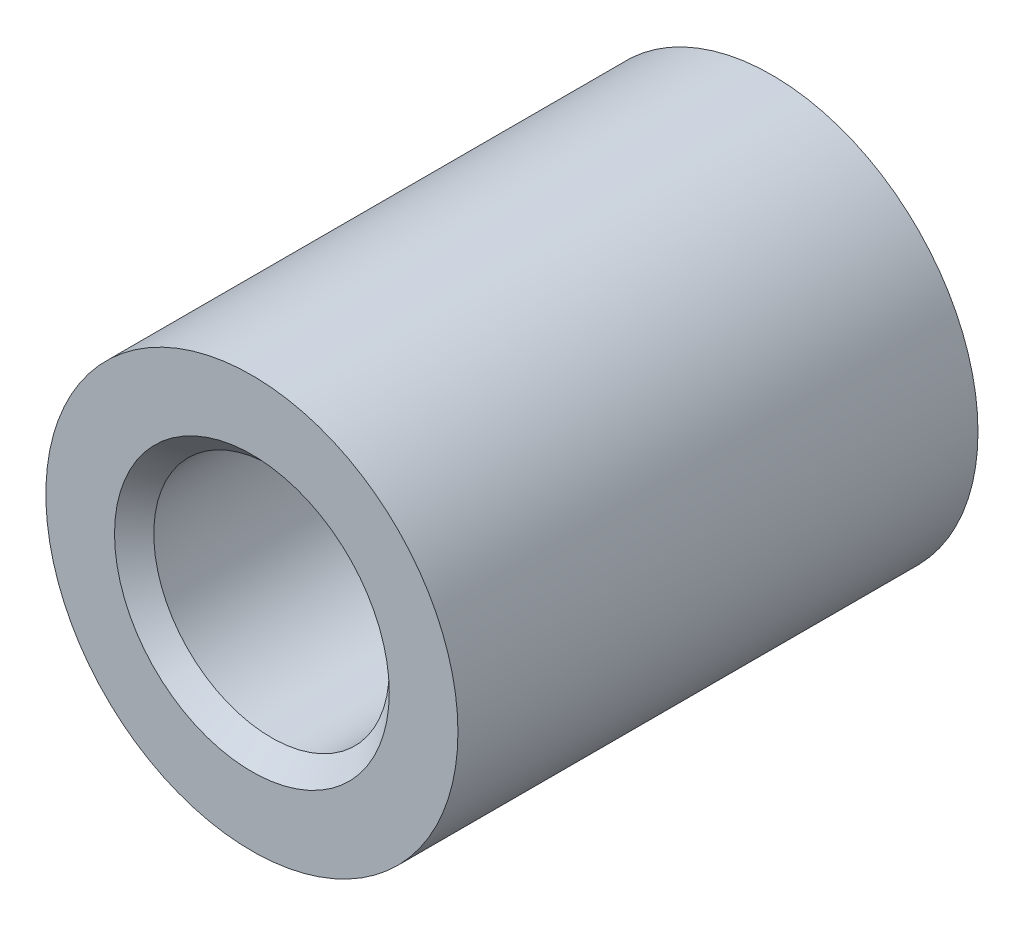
from build123d import *

# Parameters (mm, degrees)
ESQUISSE1_R          = 10.5
ESQUISSE1_R_2        = 6
BASE_EXTRUSION_DEPTH = 26.5
CHANFREIN1_SIZE      = 1


with BuildPart() as part:
    # Esquisse1 → Base-Extrusion (new body)
    with BuildSketch(Plane.XY):
        Circle(ESQUISSE1_R)
        Circle(ESQUISSE1_R_2, mode=Mode.SUBTRACT)
    extrude(amount=BASE_EXTRUSION_DEPTH)

    # Chanfrein1
    chanfrein1_edges = [part.edges().sort_by_distance(p)[0] for p in [
        (-6, 0, 26.5),
    ]]
    chamfer(chanfrein1_edges, length=CHANFREIN1_SIZE)


solid = part.part
